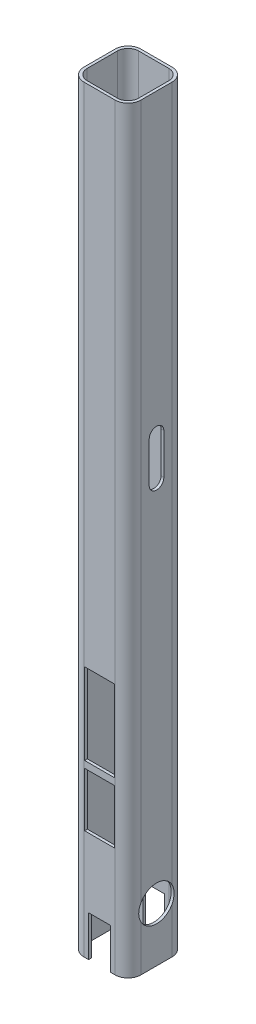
from build123d import *

# Parameters (mm, degrees)
BOSS_EXTRUDE1_DEPTH = 280
SKETCH2_R           = 6.525
CUT_EXTRUDE1_DEPTH  = 281.990326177
SKETCH3_W           = 8
SKETCH3_H           = 30
SKETCH3_W_2         = 11
SKETCH3_H_2         = 20
CUT_EXTRUDE2_DEPTH  = 281.990326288
SKETCH4_W           = 11
SKETCH4_H           = 35
CUT_EXTRUDE3_DEPTH  = 10
SKETCH5_W           = 11
SKETCH5_H           = 30
CUT_EXTRUDE4_DEPTH  = 10
CUT_EXTRUDE7_DEPTH  = 281.990326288


with BuildPart() as part:
    # Sketch1 → Boss-Extrude1 (new body)
    with BuildSketch(Plane(origin=(0, 0, 0), x_dir=(1, 0, 0), z_dir=(0, 1, 0))):
        with BuildLine():
            Line((-5.7785, -10.541), (5.7785, -10.541))
            ThreePointArc((5.7785, -10.541), (9.146096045, -9.146096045), (10.541, -5.7785))
            Line((10.541, -5.7785), (10.541, 5.7785))
            ThreePointArc((10.541, 5.7785), (9.146096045, 9.146096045), (5.7785, 10.541))
            Line((5.7785, 10.541), (-5.7785, 10.541))
            ThreePointArc((-5.7785, 10.541), (-9.146096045, 9.146096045), (-10.541, 5.7785))
            Line((-10.541, 5.7785), (-10.541, -5.7785))
            ThreePointArc((-10.541, -5.7785), (-9.146096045, -9.146096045), (-5.7785, -10.541))
        make_face()
        with BuildLine():
            Line((-5.55625, 9.525), (5.55625, 9.525))
            ThreePointArc((5.55625, 9.525), (8.362580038, 8.362580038), (9.525, 5.55625))
            Line((9.525, 5.55625), (9.525, -5.55625))
            ThreePointArc((9.525, -5.55625), (8.362580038, -8.362580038), (5.55625, -9.525))
            Line((5.55625, -9.525), (-5.55625, -9.525))
            ThreePointArc((-5.55625, -9.525), (-8.362580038, -8.362580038), (-9.525, -5.55625))
            Line((-9.525, -5.55625), (-9.525, 5.55625))
            ThreePointArc((-9.525, 5.55625), (-8.362580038, 8.362580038), (-5.55625, 9.525))
        make_face(mode=Mode.SUBTRACT)
    extrude(amount=BOSS_EXTRUDE1_DEPTH)

    # Sketch2 → Cut-Extrude1 (cut, through all)
    with BuildSketch(Plane(origin=(10.541, 0, 0), x_dir=(0, 0, -1), z_dir=(1, 0, 0))):
        with Locations(Location((0, 20, 0), (0, 0, 332.324691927))):
            Circle(SKETCH2_R)
    extrude(amount=-CUT_EXTRUDE1_DEPTH, mode=Mode.SUBTRACT)

    # Sketch3 → Cut-Extrude2 (cut, through all)
    with BuildSketch(Plane(origin=(0, 0, -10.541), x_dir=(-1, 0, 0), z_dir=(0, 0, -1))):
        Rectangle(SKETCH3_W, SKETCH3_H)
        with Locations((0, 50.5)):
            Rectangle(SKETCH3_W_2, SKETCH3_H_2)
    extrude(amount=-CUT_EXTRUDE2_DEPTH, mode=Mode.SUBTRACT)

    # Sketch4 → Cut-Extrude3 (cut)
    with BuildSketch(Plane(origin=(0, 0, -10.541), x_dir=(-1, 0, 0), z_dir=(0, 0, -1))):
        with Locations((0, 114.5)):
            Rectangle(SKETCH4_W, SKETCH4_H)
    extrude(amount=-CUT_EXTRUDE3_DEPTH, mode=Mode.SUBTRACT)

    # Sketch5 → Cut-Extrude4 (cut)
    with BuildSketch(Plane.XY.offset(10.541)):
        with Locations((0, 78)):
            Rectangle(SKETCH5_W, SKETCH5_H)
    extrude(amount=-CUT_EXTRUDE4_DEPTH, mode=Mode.SUBTRACT)

    # Sketch8 → Cut-Extrude7 (cut, through all)
    with BuildSketch(Plane(origin=(10.541, 0, 0), x_dir=(0, 0, -1), z_dir=(1, 0, 0))):
        with BuildLine():
            Line((2.7, 170), (2.7, 155))
            ThreePointArc((2.7, 155), (0, 152.3), (-2.7, 155))
            Line((-2.7, 155), (-2.7, 170))
            ThreePointArc((-2.7, 170), (0, 172.7), (2.7, 170))
        make_face()
    extrude(amount=-CUT_EXTRUDE7_DEPTH, mode=Mode.SUBTRACT)


solid = part.part
